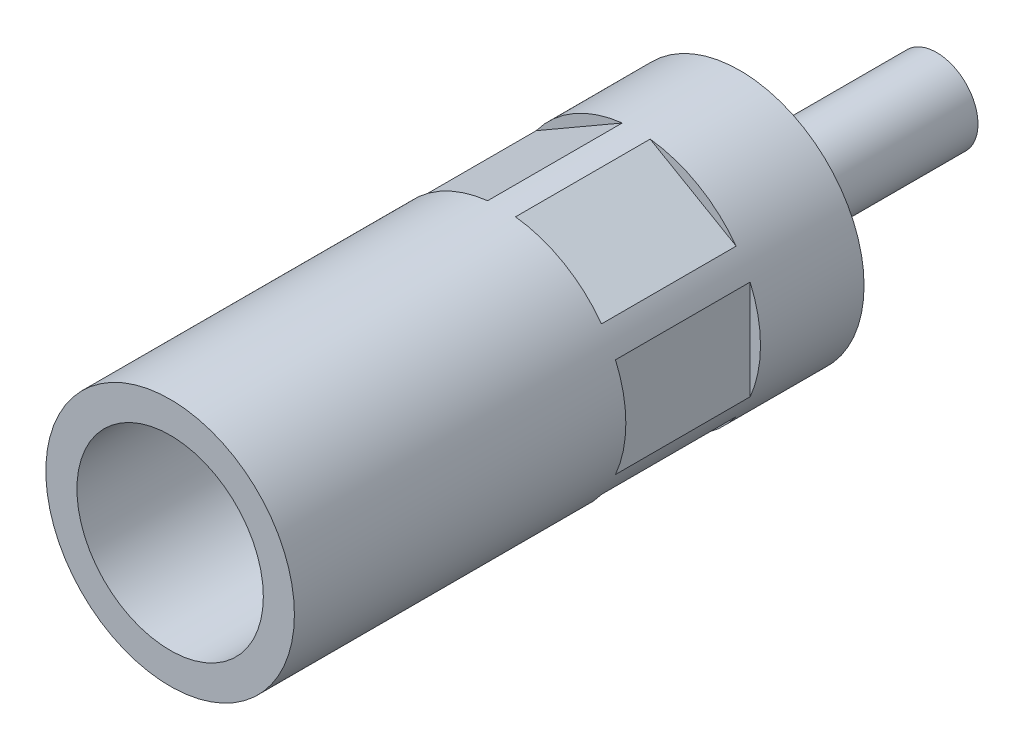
ISO-10303-21;
HEADER;
FILE_DESCRIPTION(('STEP AP214'),'2;1');
FILE_NAME('part.step','',(''),(''),'','','');
FILE_SCHEMA(('AUTOMOTIVE_DESIGN { 1 0 10303 214 1 1 1 1 }'));
ENDSEC;
DATA;
#1=APPLICATION_CONTEXT('core data for automotive mechanical design processes');
#2=APPLICATION_PROTOCOL_DEFINITION('international standard','automotive_design',2000,#1);
#3=PRODUCT_CONTEXT('',#1,'mechanical');
#4=PRODUCT('Part','Part','',(#3));
#5=PRODUCT_RELATED_PRODUCT_CATEGORY('part','',(#4));
#6=PRODUCT_DEFINITION_FORMATION('','',#4);
#7=PRODUCT_DEFINITION_CONTEXT('part definition',#1,'design');
#8=PRODUCT_DEFINITION('design','',#6,#7);
#9=PRODUCT_DEFINITION_SHAPE('','',#8);
#10=(LENGTH_UNIT() NAMED_UNIT(*) SI_UNIT(.MILLI.,.METRE.));
#11=(NAMED_UNIT(*) PLANE_ANGLE_UNIT() SI_UNIT($,.RADIAN.));
#12=(NAMED_UNIT(*) SI_UNIT($,.STERADIAN.) SOLID_ANGLE_UNIT());
#13=UNCERTAINTY_MEASURE_WITH_UNIT(LENGTH_MEASURE(1.E-05),#10,'distance_accuracy_value','');
#14=(GEOMETRIC_REPRESENTATION_CONTEXT(3) GLOBAL_UNCERTAINTY_ASSIGNED_CONTEXT((#13)) GLOBAL_UNIT_ASSIGNED_CONTEXT((#10,
#11,#12)) REPRESENTATION_CONTEXT('',''));
#15=CARTESIAN_POINT('',(0.,0.,0.));
#16=DIRECTION('',(0.,0.,1.));
#17=DIRECTION('',(1.,0.,0.));
#18=AXIS2_PLACEMENT_3D('',#15,#16,#17);
#19=CARTESIAN_POINT('',(0.,0.,80.));
#20=DIRECTION('',(0.,0.,1.));
#21=DIRECTION('',(1.,0.,0.));
#22=AXIS2_PLACEMENT_3D('',#19,#20,#21);
#23=CYLINDRICAL_SURFACE('',#22,12.);
#24=CARTESIAN_POINT('',(0.,0.,10.));
#25=DIRECTION('',(0.,0.,1.));
#26=DIRECTION('',(1.,0.,0.));
#27=AXIS2_PLACEMENT_3D('',#24,#25,#26);
#28=CIRCLE('',#27,12.);
#29=CARTESIAN_POINT('',(-9.653311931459,-7.12836367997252,10.));
#30=VERTEX_POINT('',#29);
#31=CARTESIAN_POINT('',(-1.34668806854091,-11.9241952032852,10.));
#32=VERTEX_POINT('',#31);
#33=EDGE_CURVE('E153',#30,#32,#28,.T.);
#34=ORIENTED_EDGE('',*,*,#33,.F.);
#35=DIRECTION('',(0.,0.,1.));
#36=VECTOR('',#35,1.);
#37=CARTESIAN_POINT('',(-9.65331193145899,-7.12836367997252,80.));
#38=LINE('',#37,#36);
#39=CARTESIAN_POINT('',(-9.653311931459,-7.12836367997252,23.));
#40=VERTEX_POINT('',#39);
#41=EDGE_CURVE('E9',#30,#40,#38,.T.);
#42=ORIENTED_EDGE('',*,*,#41,.T.);
#43=CARTESIAN_POINT('',(0.,0.,23.));
#44=DIRECTION('',(0.,0.,1.));
#45=DIRECTION('',(1.,0.,0.));
#46=AXIS2_PLACEMENT_3D('',#43,#44,#45);
#47=CIRCLE('',#46,12.);
#48=CARTESIAN_POINT('',(-1.34668806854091,-11.9241952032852,23.));
#49=VERTEX_POINT('',#48);
#50=EDGE_CURVE('E22',#40,#49,#47,.T.);
#51=ORIENTED_EDGE('',*,*,#50,.T.);
#52=DIRECTION('',(0.,0.,1.));
#53=VECTOR('',#52,1.);
#54=CARTESIAN_POINT('',(-1.34668806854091,-11.9241952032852,80.));
#55=LINE('',#54,#53);
#56=EDGE_CURVE('E150',#49,#32,#55,.F.);
#57=ORIENTED_EDGE('',*,*,#56,.T.);
#58=EDGE_LOOP('',(#34,#42,#51,#57));
#59=FACE_BOUND('',#58,.T.);
#60=DIRECTION('',(0.,0.,1.));
#61=VECTOR('',#60,1.);
#62=CARTESIAN_POINT('',(11.,4.79583152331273,80.));
#63=LINE('',#62,#61);
#64=CARTESIAN_POINT('',(11.,4.79583152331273,10.));
#65=VERTEX_POINT('',#64);
#66=CARTESIAN_POINT('',(11.,4.79583152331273,23.));
#67=VERTEX_POINT('',#66);
#68=EDGE_CURVE('E143',#65,#67,#63,.T.);
#69=ORIENTED_EDGE('',*,*,#68,.F.);
#70=CARTESIAN_POINT('',(11.,-4.79583152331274,10.));
#71=VERTEX_POINT('',#70);
#72=EDGE_CURVE('E142',#71,#65,#28,.T.);
#73=ORIENTED_EDGE('',*,*,#72,.F.);
#74=DIRECTION('',(0.,0.,1.));
#75=VECTOR('',#74,1.);
#76=CARTESIAN_POINT('',(11.,-4.79583152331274,80.));
#77=LINE('',#76,#75);
#78=CARTESIAN_POINT('',(11.,-4.79583152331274,23.));
#79=VERTEX_POINT('',#78);
#80=EDGE_CURVE('E139',#79,#71,#77,.F.);
#81=ORIENTED_EDGE('',*,*,#80,.F.);
#82=EDGE_CURVE('E146',#79,#67,#47,.T.);
#83=ORIENTED_EDGE('',*,*,#82,.T.);
#84=EDGE_LOOP('',(#69,#73,#81,#83));
#85=FACE_BOUND('',#84,.T.);
#86=CARTESIAN_POINT('',(9.65331193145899,7.12836367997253,10.));
#87=VERTEX_POINT('',#86);
#88=CARTESIAN_POINT('',(1.34668806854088,11.9241952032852,10.));
#89=VERTEX_POINT('',#88);
#90=EDGE_CURVE('E135',#87,#89,#28,.T.);
#91=ORIENTED_EDGE('',*,*,#90,.F.);
#92=DIRECTION('',(0.,0.,1.));
#93=VECTOR('',#92,1.);
#94=CARTESIAN_POINT('',(9.65331193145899,7.12836367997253,80.));
#95=LINE('',#94,#93);
#96=CARTESIAN_POINT('',(9.65331193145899,7.12836367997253,23.));
#97=VERTEX_POINT('',#96);
#98=EDGE_CURVE('E136',#87,#97,#95,.T.);
#99=ORIENTED_EDGE('',*,*,#98,.T.);
#100=CARTESIAN_POINT('',(1.34668806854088,11.9241952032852,23.));
#101=VERTEX_POINT('',#100);
#102=EDGE_CURVE('E140',#97,#101,#47,.T.);
#103=ORIENTED_EDGE('',*,*,#102,.T.);
#104=DIRECTION('',(0.,0.,1.));
#105=VECTOR('',#104,1.);
#106=CARTESIAN_POINT('',(1.34668806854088,11.9241952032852,80.));
#107=LINE('',#106,#105);
#108=EDGE_CURVE('E132',#101,#89,#107,.F.);
#109=ORIENTED_EDGE('',*,*,#108,.T.);
#110=EDGE_LOOP('',(#91,#99,#103,#109));
#111=FACE_BOUND('',#110,.T.);
#112=CARTESIAN_POINT('',(0.,0.,0.));
#113=DIRECTION('',(0.,0.,1.));
#114=DIRECTION('',(1.,0.,0.));
#115=AXIS2_PLACEMENT_3D('',#112,#113,#114);
#116=CIRCLE('',#115,12.);
#117=CARTESIAN_POINT('',(12.,0.,0.));
#118=VERTEX_POINT('',#117);
#119=EDGE_CURVE('E211',#118,#118,#116,.T.);
#120=ORIENTED_EDGE('',*,*,#119,.T.);
#121=EDGE_LOOP('',(#120));
#122=FACE_BOUND('',#121,.T.);
#123=CARTESIAN_POINT('',(0.,0.,55.));
#124=DIRECTION('',(0.,0.,1.));
#125=DIRECTION('',(1.,0.,0.));
#126=AXIS2_PLACEMENT_3D('',#123,#124,#125);
#127=CIRCLE('',#126,12.);
#128=CARTESIAN_POINT('',(12.,0.,55.));
#129=VERTEX_POINT('',#128);
#130=EDGE_CURVE('E208',#129,#129,#127,.T.);
#131=ORIENTED_EDGE('',*,*,#130,.F.);
#132=EDGE_LOOP('',(#131));
#133=FACE_BOUND('',#132,.T.);
#134=CARTESIAN_POINT('',(-11.,4.79583152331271,10.));
#135=VERTEX_POINT('',#134);
#136=CARTESIAN_POINT('',(-11.,-4.79583152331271,10.));
#137=VERTEX_POINT('',#136);
#138=EDGE_CURVE('E111',#135,#137,#28,.T.);
#139=ORIENTED_EDGE('',*,*,#138,.F.);
#140=DIRECTION('',(0.,0.,1.));
#141=VECTOR('',#140,1.);
#142=CARTESIAN_POINT('',(-11.,4.79583152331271,80.));
#143=LINE('',#142,#141);
#144=CARTESIAN_POINT('',(-11.,4.79583152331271,23.));
#145=VERTEX_POINT('',#144);
#146=EDGE_CURVE('E110',#135,#145,#143,.T.);
#147=ORIENTED_EDGE('',*,*,#146,.T.);
#148=CARTESIAN_POINT('',(-11.,-4.79583152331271,23.));
#149=VERTEX_POINT('',#148);
#150=EDGE_CURVE('E103',#145,#149,#47,.T.);
#151=ORIENTED_EDGE('',*,*,#150,.T.);
#152=DIRECTION('',(0.,0.,1.));
#153=VECTOR('',#152,1.);
#154=CARTESIAN_POINT('',(-11.,-4.79583152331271,80.));
#155=LINE('',#154,#153);
#156=EDGE_CURVE('E117',#149,#137,#155,.F.);
#157=ORIENTED_EDGE('',*,*,#156,.T.);
#158=EDGE_LOOP('',(#139,#147,#151,#157));
#159=FACE_BOUND('',#158,.T.);
#160=DIRECTION('',(0.,0.,1.));
#161=VECTOR('',#160,1.);
#162=CARTESIAN_POINT('',(-9.65331193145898,7.12836367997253,80.));
#163=LINE('',#162,#161);
#164=CARTESIAN_POINT('',(-9.65331193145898,7.12836367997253,10.));
#165=VERTEX_POINT('',#164);
#166=CARTESIAN_POINT('',(-9.65331193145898,7.12836367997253,23.));
#167=VERTEX_POINT('',#166);
#168=EDGE_CURVE('E130',#165,#167,#163,.T.);
#169=ORIENTED_EDGE('',*,*,#168,.F.);
#170=CARTESIAN_POINT('',(-1.3466880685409,11.9241952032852,10.));
#171=VERTEX_POINT('',#170);
#172=EDGE_CURVE('E126',#171,#165,#28,.T.);
#173=ORIENTED_EDGE('',*,*,#172,.F.);
#174=DIRECTION('',(0.,0.,1.));
#175=VECTOR('',#174,1.);
#176=CARTESIAN_POINT('',(-1.3466880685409,11.9241952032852,80.));
#177=LINE('',#176,#175);
#178=CARTESIAN_POINT('',(-1.3466880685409,11.9241952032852,23.));
#179=VERTEX_POINT('',#178);
#180=EDGE_CURVE('E124',#179,#171,#177,.F.);
#181=ORIENTED_EDGE('',*,*,#180,.F.);
#182=EDGE_CURVE('E113',#179,#167,#47,.T.);
#183=ORIENTED_EDGE('',*,*,#182,.T.);
#184=EDGE_LOOP('',(#169,#173,#181,#183));
#185=FACE_BOUND('',#184,.T.);
#186=DIRECTION('',(0.,0.,1.));
#187=VECTOR('',#186,1.);
#188=CARTESIAN_POINT('',(9.65331193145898,-7.12836367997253,80.));
#189=LINE('',#188,#187);
#190=CARTESIAN_POINT('',(9.65331193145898,-7.12836367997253,10.));
#191=VERTEX_POINT('',#190);
#192=CARTESIAN_POINT('',(9.65331193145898,-7.12836367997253,23.));
#193=VERTEX_POINT('',#192);
#194=EDGE_CURVE('E149',#191,#193,#189,.T.);
#195=ORIENTED_EDGE('',*,*,#194,.F.);
#196=CARTESIAN_POINT('',(1.34668806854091,-11.9241952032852,10.));
#197=VERTEX_POINT('',#196);
#198=EDGE_CURVE('E148',#197,#191,#28,.T.);
#199=ORIENTED_EDGE('',*,*,#198,.F.);
#200=DIRECTION('',(0.,0.,1.));
#201=VECTOR('',#200,1.);
#202=CARTESIAN_POINT('',(1.34668806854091,-11.9241952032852,80.));
#203=LINE('',#202,#201);
#204=CARTESIAN_POINT('',(1.34668806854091,-11.9241952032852,23.));
#205=VERTEX_POINT('',#204);
#206=EDGE_CURVE('E145',#205,#197,#203,.F.);
#207=ORIENTED_EDGE('',*,*,#206,.F.);
#208=EDGE_CURVE('E151',#205,#193,#47,.T.);
#209=ORIENTED_EDGE('',*,*,#208,.T.);
#210=EDGE_LOOP('',(#195,#199,#207,#209));
#211=FACE_BOUND('',#210,.T.);
#212=ADVANCED_FACE('F14',(#59,#85,#111,#122,#133,#159,#185,#211),#23,.T.);
#213=CARTESIAN_POINT('',(0.,0.,-19.));
#214=DIRECTION('',(0.,0.,1.));
#215=DIRECTION('',(1.,0.,0.));
#216=AXIS2_PLACEMENT_3D('',#213,#214,#215);
#217=PLANE('',#216);
#218=CARTESIAN_POINT('',(0.,0.,-19.));
#219=DIRECTION('',(0.,0.,1.));
#220=DIRECTION('',(1.,0.,0.));
#221=AXIS2_PLACEMENT_3D('',#218,#219,#220);
#222=CIRCLE('',#221,4.);
#223=CARTESIAN_POINT('',(4.,0.,-19.));
#224=VERTEX_POINT('',#223);
#225=EDGE_CURVE('E160',#224,#224,#222,.T.);
#226=ORIENTED_EDGE('',*,*,#225,.F.);
#227=EDGE_LOOP('',(#226));
#228=FACE_BOUND('',#227,.T.);
#229=ADVANCED_FACE('F16',(#228),#217,.F.);
#230=CARTESIAN_POINT('',(0.,0.,80.));
#231=DIRECTION('',(0.,0.,1.));
#232=DIRECTION('',(1.,0.,0.));
#233=AXIS2_PLACEMENT_3D('',#230,#231,#232);
#234=CYLINDRICAL_SURFACE('',#233,4.);
#235=CARTESIAN_POINT('',(0.,0.,0.));
#236=DIRECTION('',(0.,0.,1.));
#237=DIRECTION('',(1.,0.,0.));
#238=AXIS2_PLACEMENT_3D('',#235,#236,#237);
#239=CIRCLE('',#238,4.);
#240=CARTESIAN_POINT('',(4.,0.,0.));
#241=VERTEX_POINT('',#240);
#242=EDGE_CURVE('E214',#241,#241,#239,.T.);
#243=ORIENTED_EDGE('',*,*,#242,.F.);
#244=EDGE_LOOP('',(#243));
#245=FACE_BOUND('',#244,.T.);
#246=ORIENTED_EDGE('',*,*,#225,.T.);
#247=EDGE_LOOP('',(#246));
#248=FACE_BOUND('',#247,.T.);
#249=ADVANCED_FACE('F220',(#245,#248),#234,.T.);
#250=CARTESIAN_POINT('',(12.,0.,0.));
#251=DIRECTION('',(0.,0.,-1.));
#252=DIRECTION('',(-1.,0.,0.));
#253=AXIS2_PLACEMENT_3D('',#250,#251,#252);
#254=PLANE('',#253);
#255=ORIENTED_EDGE('',*,*,#242,.T.);
#256=EDGE_LOOP('',(#255));
#257=FACE_BOUND('',#256,.T.);
#258=ORIENTED_EDGE('',*,*,#119,.F.);
#259=EDGE_LOOP('',(#258));
#260=FACE_BOUND('',#259,.T.);
#261=ADVANCED_FACE('F229',(#257,#260),#254,.T.);
#262=CARTESIAN_POINT('',(12.,0.,55.));
#263=DIRECTION('',(0.,0.,-1.));
#264=DIRECTION('',(-1.,0.,0.));
#265=AXIS2_PLACEMENT_3D('',#262,#263,#264);
#266=PLANE('',#265);
#267=CARTESIAN_POINT('',(0.,0.,55.));
#268=DIRECTION('',(0.,0.,1.));
#269=DIRECTION('',(1.,0.,0.));
#270=AXIS2_PLACEMENT_3D('',#267,#268,#269);
#271=CIRCLE('',#270,9.);
#272=CARTESIAN_POINT('',(9.,0.,55.));
#273=VERTEX_POINT('',#272);
#274=EDGE_CURVE('E205',#273,#273,#271,.T.);
#275=ORIENTED_EDGE('',*,*,#274,.F.);
#276=EDGE_LOOP('',(#275));
#277=FACE_BOUND('',#276,.T.);
#278=ORIENTED_EDGE('',*,*,#130,.T.);
#279=EDGE_LOOP('',(#278));
#280=FACE_BOUND('',#279,.T.);
#281=ADVANCED_FACE('F237',(#277,#280),#266,.F.);
#282=CARTESIAN_POINT('',(0.,0.,80.));
#283=DIRECTION('',(0.,0.,1.));
#284=DIRECTION('',(1.,0.,0.));
#285=AXIS2_PLACEMENT_3D('',#282,#283,#284);
#286=CYLINDRICAL_SURFACE('',#285,9.);
#287=CARTESIAN_POINT('',(0.,0.,30.));
#288=DIRECTION('',(0.,0.,1.));
#289=DIRECTION('',(1.,0.,0.));
#290=AXIS2_PLACEMENT_3D('',#287,#288,#289);
#291=CIRCLE('',#290,9.);
#292=CARTESIAN_POINT('',(9.,0.,30.));
#293=VERTEX_POINT('',#292);
#294=EDGE_CURVE('E202',#293,#293,#291,.T.);
#295=ORIENTED_EDGE('',*,*,#294,.F.);
#296=EDGE_LOOP('',(#295));
#297=FACE_BOUND('',#296,.T.);
#298=ORIENTED_EDGE('',*,*,#274,.T.);
#299=EDGE_LOOP('',(#298));
#300=FACE_BOUND('',#299,.T.);
#301=ADVANCED_FACE('F245',(#297,#300),#286,.F.);
#302=CARTESIAN_POINT('',(4.,0.,30.));
#303=DIRECTION('',(0.,0.,1.));
#304=DIRECTION('',(1.,0.,0.));
#305=AXIS2_PLACEMENT_3D('',#302,#303,#304);
#306=PLANE('',#305);
#307=ORIENTED_EDGE('',*,*,#294,.T.);
#308=EDGE_LOOP('',(#307));
#309=FACE_BOUND('',#308,.T.);
#310=CARTESIAN_POINT('',(0.,0.,30.));
#311=DIRECTION('',(0.,0.,1.));
#312=DIRECTION('',(1.,0.,0.));
#313=AXIS2_PLACEMENT_3D('',#310,#311,#312);
#314=CIRCLE('',#313,4.);
#315=CARTESIAN_POINT('',(4.,0.,30.));
#316=VERTEX_POINT('',#315);
#317=EDGE_CURVE('E199',#316,#316,#314,.T.);
#318=ORIENTED_EDGE('',*,*,#317,.F.);
#319=EDGE_LOOP('',(#318));
#320=FACE_BOUND('',#319,.T.);
#321=ADVANCED_FACE('F258',(#309,#320),#306,.T.);
#322=CARTESIAN_POINT('',(0.,0.,80.));
#323=DIRECTION('',(0.,0.,1.));
#324=DIRECTION('',(1.,0.,0.));
#325=AXIS2_PLACEMENT_3D('',#322,#323,#324);
#326=CYLINDRICAL_SURFACE('',#325,4.);
#327=CARTESIAN_POINT('',(0.,0.,10.));
#328=DIRECTION('',(0.,0.,1.));
#329=DIRECTION('',(1.,0.,0.));
#330=AXIS2_PLACEMENT_3D('',#327,#328,#329);
#331=CIRCLE('',#330,4.);
#332=CARTESIAN_POINT('',(4.,0.,10.));
#333=VERTEX_POINT('',#332);
#334=EDGE_CURVE('E118',#333,#333,#331,.T.);
#335=ORIENTED_EDGE('',*,*,#334,.F.);
#336=EDGE_LOOP('',(#335));
#337=FACE_BOUND('',#336,.T.);
#338=ORIENTED_EDGE('',*,*,#317,.T.);
#339=EDGE_LOOP('',(#338));
#340=FACE_BOUND('',#339,.T.);
#341=ADVANCED_FACE('F266',(#337,#340),#326,.F.);
#342=CARTESIAN_POINT('',(4.,0.,10.));
#343=DIRECTION('',(0.,0.,-1.));
#344=DIRECTION('',(-1.,0.,0.));
#345=AXIS2_PLACEMENT_3D('',#342,#343,#344);
#346=PLANE('',#345);
#347=ORIENTED_EDGE('',*,*,#334,.T.);
#348=EDGE_LOOP('',(#347));
#349=FACE_BOUND('',#348,.T.);
#350=ADVANCED_FACE('F273',(#349),#346,.F.);
#351=CARTESIAN_POINT('',(-11.,6.35085296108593,23.));
#352=DIRECTION('',(1.,0.,0.));
#353=DIRECTION('',(0.,0.,-1.));
#354=AXIS2_PLACEMENT_3D('',#351,#352,#353);
#355=PLANE('',#354);
#356=DIRECTION('',(0.,-1.,0.));
#357=VECTOR('',#356,1.);
#358=CARTESIAN_POINT('',(-11.,6.35085296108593,10.));
#359=LINE('',#358,#357);
#360=EDGE_CURVE('E193',#135,#137,#359,.T.);
#361=ORIENTED_EDGE('',*,*,#360,.T.);
#362=ORIENTED_EDGE('',*,*,#156,.F.);
#363=DIRECTION('',(0.,-1.,0.));
#364=VECTOR('',#363,1.);
#365=CARTESIAN_POINT('',(-11.,6.35085296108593,23.));
#366=LINE('',#365,#364);
#367=EDGE_CURVE('E106',#145,#149,#366,.T.);
#368=ORIENTED_EDGE('',*,*,#367,.F.);
#369=ORIENTED_EDGE('',*,*,#146,.F.);
#370=EDGE_LOOP('',(#361,#362,#368,#369));
#371=FACE_BOUND('',#370,.T.);
#372=ADVANCED_FACE('F115',(#371),#355,.F.);
#373=CARTESIAN_POINT('',(0.,0.,10.));
#374=DIRECTION('',(0.,0.,1.));
#375=DIRECTION('',(1.,0.,0.));
#376=AXIS2_PLACEMENT_3D('',#373,#374,#375);
#377=PLANE('',#376);
#378=ORIENTED_EDGE('',*,*,#138,.T.);
#379=ORIENTED_EDGE('',*,*,#360,.F.);
#380=EDGE_LOOP('',(#378,#379));
#381=FACE_BOUND('',#380,.T.);
#382=ADVANCED_FACE('F307',(#381),#377,.T.);
#383=CARTESIAN_POINT('',(0.,0.,23.));
#384=DIRECTION('',(0.,0.,1.));
#385=DIRECTION('',(1.,0.,0.));
#386=AXIS2_PLACEMENT_3D('',#383,#384,#385);
#387=PLANE('',#386);
#388=ORIENTED_EDGE('',*,*,#367,.T.);
#389=ORIENTED_EDGE('',*,*,#150,.F.);
#390=EDGE_LOOP('',(#388,#389));
#391=FACE_BOUND('',#390,.T.);
#392=ADVANCED_FACE('F105',(#391),#387,.F.);
#393=CARTESIAN_POINT('',(-11.,6.35085296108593,23.));
#394=DIRECTION('',(-0.5,0.866025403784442,0.));
#395=DIRECTION('',(-0.866025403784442,-0.5,0.));
#396=AXIS2_PLACEMENT_3D('',#393,#394,#395);
#397=PLANE('',#396);
#398=ORIENTED_EDGE('',*,*,#168,.T.);
#399=DIRECTION('',(0.866025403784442,0.5,0.));
#400=VECTOR('',#399,1.);
#401=CARTESIAN_POINT('',(-11.,6.35085296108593,23.));
#402=LINE('',#401,#400);
#403=EDGE_CURVE('E119',#167,#179,#402,.T.);
#404=ORIENTED_EDGE('',*,*,#403,.T.);
#405=ORIENTED_EDGE('',*,*,#180,.T.);
#406=DIRECTION('',(0.866025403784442,0.5,0.));
#407=VECTOR('',#406,1.);
#408=CARTESIAN_POINT('',(-11.,6.35085296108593,10.));
#409=LINE('',#408,#407);
#410=EDGE_CURVE('E342',#165,#171,#409,.T.);
#411=ORIENTED_EDGE('',*,*,#410,.F.);
#412=EDGE_LOOP('',(#398,#404,#405,#411));
#413=FACE_BOUND('',#412,.T.);
#414=ADVANCED_FACE('F301',(#413),#397,.T.);
#415=ORIENTED_EDGE('',*,*,#172,.T.);
#416=ORIENTED_EDGE('',*,*,#410,.T.);
#417=EDGE_LOOP('',(#415,#416));
#418=FACE_BOUND('',#417,.T.);
#419=ADVANCED_FACE('F289',(#418),#377,.T.);
#420=ORIENTED_EDGE('',*,*,#403,.F.);
#421=ORIENTED_EDGE('',*,*,#182,.F.);
#422=EDGE_LOOP('',(#420,#421));
#423=FACE_BOUND('',#422,.T.);
#424=ADVANCED_FACE('F284',(#423),#387,.F.);
#425=CARTESIAN_POINT('',(11.,6.35085296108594,23.));
#426=DIRECTION('',(-0.499999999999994,-0.866025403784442,0.));
#427=DIRECTION('',(0.866025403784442,-0.499999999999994,0.));
#428=AXIS2_PLACEMENT_3D('',#425,#426,#427);
#429=PLANE('',#428);
#430=DIRECTION('',(-0.866025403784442,0.499999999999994,0.));
#431=VECTOR('',#430,1.);
#432=CARTESIAN_POINT('',(11.,6.35085296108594,10.));
#433=LINE('',#432,#431);
#434=EDGE_CURVE('E343',#87,#89,#433,.T.);
#435=ORIENTED_EDGE('',*,*,#434,.T.);
#436=ORIENTED_EDGE('',*,*,#108,.F.);
#437=DIRECTION('',(-0.866025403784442,0.499999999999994,0.));
#438=VECTOR('',#437,1.);
#439=CARTESIAN_POINT('',(11.,6.35085296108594,23.));
#440=LINE('',#439,#438);
#441=EDGE_CURVE('E190',#97,#101,#440,.T.);
#442=ORIENTED_EDGE('',*,*,#441,.F.);
#443=ORIENTED_EDGE('',*,*,#98,.F.);
#444=EDGE_LOOP('',(#435,#436,#442,#443));
#445=FACE_BOUND('',#444,.T.);
#446=ADVANCED_FACE('F288',(#445),#429,.F.);
#447=ORIENTED_EDGE('',*,*,#90,.T.);
#448=ORIENTED_EDGE('',*,*,#434,.F.);
#449=EDGE_LOOP('',(#447,#448));
#450=FACE_BOUND('',#449,.T.);
#451=ADVANCED_FACE('F282',(#450),#377,.T.);
#452=ORIENTED_EDGE('',*,*,#441,.T.);
#453=ORIENTED_EDGE('',*,*,#102,.F.);
#454=EDGE_LOOP('',(#452,#453));
#455=FACE_BOUND('',#454,.T.);
#456=ADVANCED_FACE('F278',(#455),#387,.F.);
#457=CARTESIAN_POINT('',(11.,6.35085296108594,23.));
#458=DIRECTION('',(1.,0.,0.));
#459=DIRECTION('',(0.,1.,0.));
#460=AXIS2_PLACEMENT_3D('',#457,#458,#459);
#461=PLANE('',#460);
#462=ORIENTED_EDGE('',*,*,#68,.T.);
#463=DIRECTION('',(0.,-1.,0.));
#464=VECTOR('',#463,1.);
#465=CARTESIAN_POINT('',(11.,6.35085296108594,23.));
#466=LINE('',#465,#464);
#467=EDGE_CURVE('E187',#67,#79,#466,.T.);
#468=ORIENTED_EDGE('',*,*,#467,.T.);
#469=ORIENTED_EDGE('',*,*,#80,.T.);
#470=DIRECTION('',(0.,-1.,0.));
#471=VECTOR('',#470,1.);
#472=CARTESIAN_POINT('',(11.,6.35085296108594,10.));
#473=LINE('',#472,#471);
#474=EDGE_CURVE('E346',#65,#71,#473,.T.);
#475=ORIENTED_EDGE('',*,*,#474,.F.);
#476=EDGE_LOOP('',(#462,#468,#469,#475));
#477=FACE_BOUND('',#476,.T.);
#478=ADVANCED_FACE('F281',(#477),#461,.T.);
#479=ORIENTED_EDGE('',*,*,#72,.T.);
#480=ORIENTED_EDGE('',*,*,#474,.T.);
#481=EDGE_LOOP('',(#479,#480));
#482=FACE_BOUND('',#481,.T.);
#483=ADVANCED_FACE('F290',(#482),#377,.T.);
#484=ORIENTED_EDGE('',*,*,#467,.F.);
#485=ORIENTED_EDGE('',*,*,#82,.F.);
#486=EDGE_LOOP('',(#484,#485));
#487=FACE_BOUND('',#486,.T.);
#488=ADVANCED_FACE('F285',(#487),#387,.F.);
#489=CARTESIAN_POINT('',(11.,-6.35085296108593,23.));
#490=DIRECTION('',(0.5,-0.866025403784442,0.));
#491=DIRECTION('',(0.866025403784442,0.5,0.));
#492=AXIS2_PLACEMENT_3D('',#489,#490,#491);
#493=PLANE('',#492);
#494=ORIENTED_EDGE('',*,*,#194,.T.);
#495=DIRECTION('',(-0.866025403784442,-0.5,0.));
#496=VECTOR('',#495,1.);
#497=CARTESIAN_POINT('',(11.,-6.35085296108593,23.));
#498=LINE('',#497,#496);
#499=EDGE_CURVE('E37',#193,#205,#498,.T.);
#500=ORIENTED_EDGE('',*,*,#499,.T.);
#501=ORIENTED_EDGE('',*,*,#206,.T.);
#502=DIRECTION('',(-0.866025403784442,-0.5,0.));
#503=VECTOR('',#502,1.);
#504=CARTESIAN_POINT('',(11.,-6.35085296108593,10.));
#505=LINE('',#504,#503);
#506=EDGE_CURVE('E350',#191,#197,#505,.T.);
#507=ORIENTED_EDGE('',*,*,#506,.F.);
#508=EDGE_LOOP('',(#494,#500,#501,#507));
#509=FACE_BOUND('',#508,.T.);
#510=ADVANCED_FACE('F291',(#509),#493,.T.);
#511=ORIENTED_EDGE('',*,*,#198,.T.);
#512=ORIENTED_EDGE('',*,*,#506,.T.);
#513=EDGE_LOOP('',(#511,#512));
#514=FACE_BOUND('',#513,.T.);
#515=ADVANCED_FACE('F294',(#514),#377,.T.);
#516=ORIENTED_EDGE('',*,*,#499,.F.);
#517=ORIENTED_EDGE('',*,*,#208,.F.);
#518=EDGE_LOOP('',(#516,#517));
#519=FACE_BOUND('',#518,.T.);
#520=ADVANCED_FACE('F186',(#519),#387,.F.);
#521=DIRECTION('',(0.866025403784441,-0.5,0.));
#522=VECTOR('',#521,1.);
#523=CARTESIAN_POINT('',(-11.,-6.35085296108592,23.));
#524=LINE('',#523,#522);
#525=EDGE_CURVE('E188',#40,#49,#524,.T.);
#526=ORIENTED_EDGE('',*,*,#525,.T.);
#527=ORIENTED_EDGE('',*,*,#50,.F.);
#528=EDGE_LOOP('',(#526,#527));
#529=FACE_BOUND('',#528,.T.);
#530=ADVANCED_FACE('F315',(#529),#387,.F.);
#531=ORIENTED_EDGE('',*,*,#33,.T.);
#532=DIRECTION('',(0.866025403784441,-0.5,0.));
#533=VECTOR('',#532,1.);
#534=CARTESIAN_POINT('',(-11.,-6.35085296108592,10.));
#535=LINE('',#534,#533);
#536=EDGE_CURVE('E29',#30,#32,#535,.T.);
#537=ORIENTED_EDGE('',*,*,#536,.F.);
#538=EDGE_LOOP('',(#531,#537));
#539=FACE_BOUND('',#538,.T.);
#540=ADVANCED_FACE('F310',(#539),#377,.T.);
#541=CARTESIAN_POINT('',(-11.,-6.35085296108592,23.));
#542=DIRECTION('',(0.5,0.866025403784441,0.));
#543=DIRECTION('',(-0.866025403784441,0.5,0.));
#544=AXIS2_PLACEMENT_3D('',#541,#542,#543);
#545=PLANE('',#544);
#546=ORIENTED_EDGE('',*,*,#536,.T.);
#547=ORIENTED_EDGE('',*,*,#56,.F.);
#548=ORIENTED_EDGE('',*,*,#525,.F.);
#549=ORIENTED_EDGE('',*,*,#41,.F.);
#550=EDGE_LOOP('',(#546,#547,#548,#549));
#551=FACE_BOUND('',#550,.T.);
#552=ADVANCED_FACE('F308',(#551),#545,.F.);
#553=CLOSED_SHELL('',(#212,#229,#249,#261,#281,#301,#321,#341,#350,#372,#382,#392,#414,#419,
#424,#446,#451,#456,#478,#483,#488,#510,#515,#520,#530,#540,#552));
#554=MANIFOLD_SOLID_BREP('B1',#553);
#555=ADVANCED_BREP_SHAPE_REPRESENTATION('',(#18,#554),#14);
#556=SHAPE_DEFINITION_REPRESENTATION(#9,#555);
ENDSEC;
END-ISO-10303-21;
